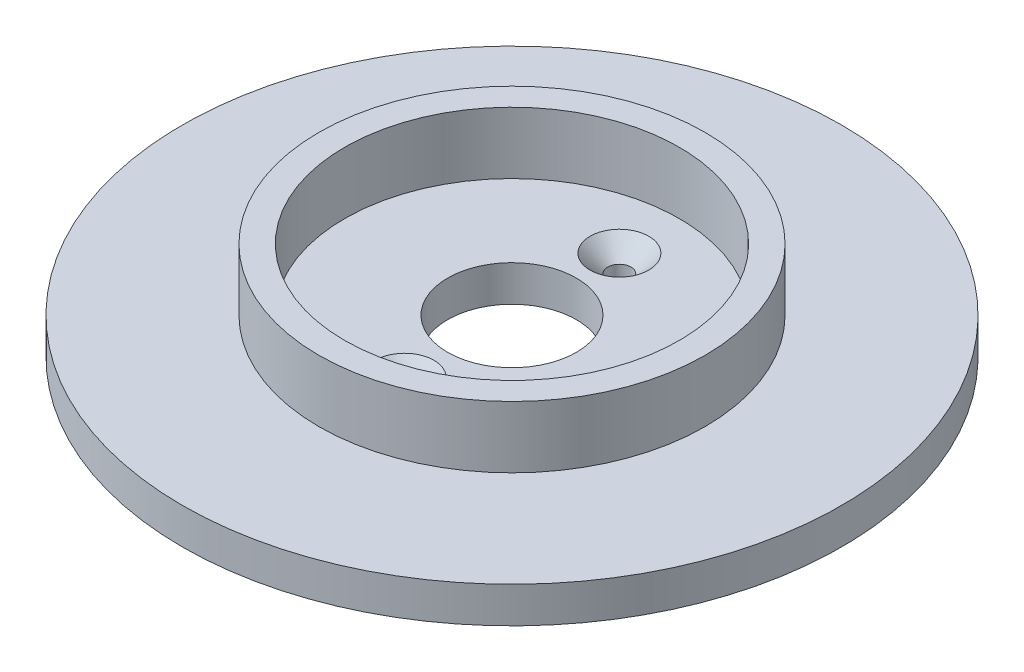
ISO-10303-21;
HEADER;
FILE_DESCRIPTION(('STEP AP214'),'2;1');
FILE_NAME('part.step','',(''),(''),'','','');
FILE_SCHEMA(('AUTOMOTIVE_DESIGN { 1 0 10303 214 1 1 1 1 }'));
ENDSEC;
DATA;
#1=APPLICATION_CONTEXT('core data for automotive mechanical design processes');
#2=APPLICATION_PROTOCOL_DEFINITION('international standard','automotive_design',2000,#1);
#3=PRODUCT_CONTEXT('',#1,'mechanical');
#4=PRODUCT('Part','Part','',(#3));
#5=PRODUCT_RELATED_PRODUCT_CATEGORY('part','',(#4));
#6=PRODUCT_DEFINITION_FORMATION('','',#4);
#7=PRODUCT_DEFINITION_CONTEXT('part definition',#1,'design');
#8=PRODUCT_DEFINITION('design','',#6,#7);
#9=PRODUCT_DEFINITION_SHAPE('','',#8);
#10=(LENGTH_UNIT() NAMED_UNIT(*) SI_UNIT(.MILLI.,.METRE.));
#11=(NAMED_UNIT(*) PLANE_ANGLE_UNIT() SI_UNIT($,.RADIAN.));
#12=(NAMED_UNIT(*) SI_UNIT($,.STERADIAN.) SOLID_ANGLE_UNIT());
#13=UNCERTAINTY_MEASURE_WITH_UNIT(LENGTH_MEASURE(1.E-05),#10,'distance_accuracy_value','');
#14=(GEOMETRIC_REPRESENTATION_CONTEXT(3) GLOBAL_UNCERTAINTY_ASSIGNED_CONTEXT((#13)) GLOBAL_UNIT_ASSIGNED_CONTEXT((#10,
#11,#12)) REPRESENTATION_CONTEXT('',''));
#15=CARTESIAN_POINT('',(0.,0.,0.));
#16=DIRECTION('',(0.,0.,1.));
#17=DIRECTION('',(1.,0.,0.));
#18=AXIS2_PLACEMENT_3D('',#15,#16,#17);
#19=CARTESIAN_POINT('',(0.,7.,0.));
#20=DIRECTION('',(0.,1.,0.));
#21=DIRECTION('',(0.,0.,1.));
#22=AXIS2_PLACEMENT_3D('',#19,#20,#21);
#23=PLANE('',#22);
#24=CARTESIAN_POINT('',(0.,7.,0.));
#25=DIRECTION('',(0.,1.,0.));
#26=DIRECTION('',(0.,0.,1.));
#27=AXIS2_PLACEMENT_3D('',#24,#25,#26);
#28=CIRCLE('',#27,64.);
#29=CARTESIAN_POINT('',(0.,7.,64.));
#30=VERTEX_POINT('',#29);
#31=EDGE_CURVE('E35',#30,#30,#28,.T.);
#32=ORIENTED_EDGE('',*,*,#31,.T.);
#33=EDGE_LOOP('',(#32));
#34=FACE_BOUND('',#33,.T.);
#35=CARTESIAN_POINT('',(0.,7.,0.));
#36=DIRECTION('',(0.,1.,0.));
#37=DIRECTION('',(0.,0.,1.));
#38=AXIS2_PLACEMENT_3D('',#35,#36,#37);
#39=CIRCLE('',#38,37.5);
#40=CARTESIAN_POINT('',(0.,7.,37.5));
#41=VERTEX_POINT('',#40);
#42=EDGE_CURVE('E46',#41,#41,#39,.T.);
#43=ORIENTED_EDGE('',*,*,#42,.F.);
#44=EDGE_LOOP('',(#43));
#45=FACE_BOUND('',#44,.T.);
#46=ADVANCED_FACE('F28',(#34,#45),#23,.T.);
#47=CARTESIAN_POINT('',(0.,7.,0.));
#48=DIRECTION('',(0.,-1.,0.));
#49=DIRECTION('',(0.,0.,-1.));
#50=AXIS2_PLACEMENT_3D('',#47,#48,#49);
#51=CYLINDRICAL_SURFACE('',#50,64.);
#52=ORIENTED_EDGE('',*,*,#31,.F.);
#53=EDGE_LOOP('',(#52));
#54=FACE_BOUND('',#53,.T.);
#55=CARTESIAN_POINT('',(0.,0.,0.));
#56=DIRECTION('',(0.,1.,0.));
#57=DIRECTION('',(0.,0.,1.));
#58=AXIS2_PLACEMENT_3D('',#55,#56,#57);
#59=CIRCLE('',#58,64.);
#60=CARTESIAN_POINT('',(0.,0.,64.));
#61=VERTEX_POINT('',#60);
#62=EDGE_CURVE('E39',#61,#61,#59,.T.);
#63=ORIENTED_EDGE('',*,*,#62,.T.);
#64=EDGE_LOOP('',(#63));
#65=FACE_BOUND('',#64,.T.);
#66=ADVANCED_FACE('F30',(#54,#65),#51,.T.);
#67=CARTESIAN_POINT('',(0.,0.,0.));
#68=DIRECTION('',(0.,1.,0.));
#69=DIRECTION('',(0.,0.,1.));
#70=AXIS2_PLACEMENT_3D('',#67,#68,#69);
#71=PLANE('',#70);
#72=CARTESIAN_POINT('',(0.,0.,-20.8566536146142));
#73=DIRECTION('',(0.,1.,0.));
#74=DIRECTION('',(0.,0.,1.));
#75=AXIS2_PLACEMENT_3D('',#72,#73,#74);
#76=CIRCLE('',#75,2.25);
#77=CARTESIAN_POINT('',(0.,0.,-18.6066536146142));
#78=VERTEX_POINT('',#77);
#79=EDGE_CURVE('E69',#78,#78,#76,.T.);
#80=ORIENTED_EDGE('',*,*,#79,.T.);
#81=EDGE_LOOP('',(#80));
#82=FACE_BOUND('',#81,.T.);
#83=CARTESIAN_POINT('',(0.,0.,20.8566536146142));
#84=DIRECTION('',(0.,1.,0.));
#85=DIRECTION('',(0.,0.,1.));
#86=AXIS2_PLACEMENT_3D('',#83,#84,#85);
#87=CIRCLE('',#86,2.25);
#88=CARTESIAN_POINT('',(0.,0.,23.1066536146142));
#89=VERTEX_POINT('',#88);
#90=EDGE_CURVE('E58',#89,#89,#87,.T.);
#91=ORIENTED_EDGE('',*,*,#90,.T.);
#92=EDGE_LOOP('',(#91));
#93=FACE_BOUND('',#92,.T.);
#94=CARTESIAN_POINT('',(0.,0.,0.));
#95=DIRECTION('',(0.,1.,0.));
#96=DIRECTION('',(0.,0.,1.));
#97=AXIS2_PLACEMENT_3D('',#94,#95,#96);
#98=CIRCLE('',#97,12.5);
#99=CARTESIAN_POINT('',(0.,0.,12.5));
#100=VERTEX_POINT('',#99);
#101=EDGE_CURVE('E54',#100,#100,#98,.T.);
#102=ORIENTED_EDGE('',*,*,#101,.T.);
#103=EDGE_LOOP('',(#102));
#104=FACE_BOUND('',#103,.T.);
#105=ORIENTED_EDGE('',*,*,#62,.F.);
#106=EDGE_LOOP('',(#105));
#107=FACE_BOUND('',#106,.T.);
#108=ADVANCED_FACE('F108',(#82,#93,#104,#107),#71,.F.);
#109=CARTESIAN_POINT('',(0.,19.,0.));
#110=DIRECTION('',(0.,1.,0.));
#111=DIRECTION('',(0.,0.,1.));
#112=AXIS2_PLACEMENT_3D('',#109,#110,#111);
#113=PLANE('',#112);
#114=CARTESIAN_POINT('',(0.,19.,0.));
#115=DIRECTION('',(0.,1.,0.));
#116=DIRECTION('',(0.,0.,1.));
#117=AXIS2_PLACEMENT_3D('',#114,#115,#116);
#118=CIRCLE('',#117,37.5);
#119=CARTESIAN_POINT('',(0.,19.,37.5));
#120=VERTEX_POINT('',#119);
#121=EDGE_CURVE('E44',#120,#120,#118,.T.);
#122=ORIENTED_EDGE('',*,*,#121,.T.);
#123=EDGE_LOOP('',(#122));
#124=FACE_BOUND('',#123,.T.);
#125=CARTESIAN_POINT('',(0.,19.,0.));
#126=DIRECTION('',(0.,1.,0.));
#127=DIRECTION('',(0.,0.,1.));
#128=AXIS2_PLACEMENT_3D('',#125,#126,#127);
#129=CIRCLE('',#128,32.5);
#130=CARTESIAN_POINT('',(0.,19.,32.5));
#131=VERTEX_POINT('',#130);
#132=EDGE_CURVE('E49',#131,#131,#129,.T.);
#133=ORIENTED_EDGE('',*,*,#132,.F.);
#134=EDGE_LOOP('',(#133));
#135=FACE_BOUND('',#134,.T.);
#136=ADVANCED_FACE('F115',(#124,#135),#113,.T.);
#137=CARTESIAN_POINT('',(0.,19.,0.));
#138=DIRECTION('',(0.,-1.,0.));
#139=DIRECTION('',(0.,0.,-1.));
#140=AXIS2_PLACEMENT_3D('',#137,#138,#139);
#141=CYLINDRICAL_SURFACE('',#140,37.5);
#142=ORIENTED_EDGE('',*,*,#121,.F.);
#143=EDGE_LOOP('',(#142));
#144=FACE_BOUND('',#143,.T.);
#145=ORIENTED_EDGE('',*,*,#42,.T.);
#146=EDGE_LOOP('',(#145));
#147=FACE_BOUND('',#146,.T.);
#148=ADVANCED_FACE('F112',(#144,#147),#141,.T.);
#149=CARTESIAN_POINT('',(0.,19.,0.));
#150=DIRECTION('',(0.,-1.,0.));
#151=DIRECTION('',(0.,0.,-1.));
#152=AXIS2_PLACEMENT_3D('',#149,#150,#151);
#153=CYLINDRICAL_SURFACE('',#152,32.5);
#154=ORIENTED_EDGE('',*,*,#132,.T.);
#155=EDGE_LOOP('',(#154));
#156=FACE_BOUND('',#155,.T.);
#157=CARTESIAN_POINT('',(0.,7.,0.));
#158=DIRECTION('',(0.,1.,0.));
#159=DIRECTION('',(0.,0.,1.));
#160=AXIS2_PLACEMENT_3D('',#157,#158,#159);
#161=CIRCLE('',#160,32.5);
#162=CARTESIAN_POINT('',(0.,7.,32.5));
#163=VERTEX_POINT('',#162);
#164=EDGE_CURVE('E10',#163,#163,#161,.F.);
#165=ORIENTED_EDGE('',*,*,#164,.T.);
#166=EDGE_LOOP('',(#165));
#167=FACE_BOUND('',#166,.T.);
#168=ADVANCED_FACE('F85',(#156,#167),#153,.F.);
#169=CARTESIAN_POINT('',(0.,7.,-20.8566536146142));
#170=DIRECTION('',(0.,1.,0.));
#171=DIRECTION('',(0.,0.,1.));
#172=AXIS2_PLACEMENT_3D('',#169,#170,#171);
#173=CIRCLE('',#172,5.7);
#174=CARTESIAN_POINT('',(0.,7.,-15.1566536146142));
#175=VERTEX_POINT('',#174);
#176=EDGE_CURVE('E75',#175,#175,#173,.T.);
#177=ORIENTED_EDGE('',*,*,#176,.F.);
#178=EDGE_LOOP('',(#177));
#179=FACE_BOUND('',#178,.T.);
#180=CARTESIAN_POINT('',(0.,7.,20.8566536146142));
#181=DIRECTION('',(0.,1.,0.));
#182=DIRECTION('',(0.,0.,1.));
#183=AXIS2_PLACEMENT_3D('',#180,#181,#182);
#184=CIRCLE('',#183,5.7);
#185=CARTESIAN_POINT('',(0.,7.,26.5566536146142));
#186=VERTEX_POINT('',#185);
#187=EDGE_CURVE('E66',#186,#186,#184,.T.);
#188=ORIENTED_EDGE('',*,*,#187,.F.);
#189=EDGE_LOOP('',(#188));
#190=FACE_BOUND('',#189,.T.);
#191=CARTESIAN_POINT('',(0.,7.,0.));
#192=DIRECTION('',(0.,1.,0.));
#193=DIRECTION('',(0.,0.,1.));
#194=AXIS2_PLACEMENT_3D('',#191,#192,#193);
#195=CIRCLE('',#194,12.5);
#196=CARTESIAN_POINT('',(0.,7.,12.5));
#197=VERTEX_POINT('',#196);
#198=EDGE_CURVE('E55',#197,#197,#195,.T.);
#199=ORIENTED_EDGE('',*,*,#198,.F.);
#200=EDGE_LOOP('',(#199));
#201=FACE_BOUND('',#200,.T.);
#202=ORIENTED_EDGE('',*,*,#164,.F.);
#203=EDGE_LOOP('',(#202));
#204=FACE_BOUND('',#203,.T.);
#205=ADVANCED_FACE('F81',(#179,#190,#201,#204),#23,.T.);
#206=CARTESIAN_POINT('',(0.,0.,0.));
#207=DIRECTION('',(0.,1.,0.));
#208=DIRECTION('',(0.,0.,1.));
#209=AXIS2_PLACEMENT_3D('',#206,#207,#208);
#210=CYLINDRICAL_SURFACE('',#209,12.5);
#211=ORIENTED_EDGE('',*,*,#101,.F.);
#212=EDGE_LOOP('',(#211));
#213=FACE_BOUND('',#212,.T.);
#214=ORIENTED_EDGE('',*,*,#198,.T.);
#215=EDGE_LOOP('',(#214));
#216=FACE_BOUND('',#215,.T.);
#217=ADVANCED_FACE('F84',(#213,#216),#210,.F.);
#218=CARTESIAN_POINT('',(0.,7.,20.8566536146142));
#219=DIRECTION('',(0.,1.,0.));
#220=DIRECTION('',(0.,0.,1.));
#221=AXIS2_PLACEMENT_3D('',#218,#219,#220);
#222=CYLINDRICAL_SURFACE('',#221,2.25);
#223=ORIENTED_EDGE('',*,*,#90,.F.);
#224=EDGE_LOOP('',(#223));
#225=FACE_BOUND('',#224,.T.);
#226=CARTESIAN_POINT('',(0.,3.55,20.8566536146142));
#227=DIRECTION('',(0.,1.,0.));
#228=DIRECTION('',(0.,0.,1.));
#229=AXIS2_PLACEMENT_3D('',#226,#227,#228);
#230=CIRCLE('',#229,2.25);
#231=CARTESIAN_POINT('',(0.,3.55,23.1066536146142));
#232=VERTEX_POINT('',#231);
#233=EDGE_CURVE('E63',#232,#232,#230,.T.);
#234=ORIENTED_EDGE('',*,*,#233,.T.);
#235=EDGE_LOOP('',(#234));
#236=FACE_BOUND('',#235,.T.);
#237=ADVANCED_FACE('F93',(#225,#236),#222,.F.);
#238=CARTESIAN_POINT('',(0.,7.,20.8566536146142));
#239=DIRECTION('',(0.,1.,0.));
#240=DIRECTION('',(0.,0.,1.));
#241=AXIS2_PLACEMENT_3D('',#238,#239,#240);
#242=CONICAL_SURFACE('',#241,5.7,0.785398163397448);
#243=ORIENTED_EDGE('',*,*,#233,.F.);
#244=EDGE_LOOP('',(#243));
#245=FACE_BOUND('',#244,.T.);
#246=ORIENTED_EDGE('',*,*,#187,.T.);
#247=EDGE_LOOP('',(#246));
#248=FACE_BOUND('',#247,.T.);
#249=ADVANCED_FACE('F99',(#245,#248),#242,.F.);
#250=CARTESIAN_POINT('',(0.,7.,-20.8566536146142));
#251=DIRECTION('',(0.,1.,0.));
#252=DIRECTION('',(0.,0.,1.));
#253=AXIS2_PLACEMENT_3D('',#250,#251,#252);
#254=CYLINDRICAL_SURFACE('',#253,2.25);
#255=ORIENTED_EDGE('',*,*,#79,.F.);
#256=EDGE_LOOP('',(#255));
#257=FACE_BOUND('',#256,.T.);
#258=CARTESIAN_POINT('',(0.,3.55,-20.8566536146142));
#259=DIRECTION('',(0.,1.,0.));
#260=DIRECTION('',(0.,0.,1.));
#261=AXIS2_PLACEMENT_3D('',#258,#259,#260);
#262=CIRCLE('',#261,2.25);
#263=CARTESIAN_POINT('',(0.,3.55,-18.6066536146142));
#264=VERTEX_POINT('',#263);
#265=EDGE_CURVE('E72',#264,#264,#262,.T.);
#266=ORIENTED_EDGE('',*,*,#265,.T.);
#267=EDGE_LOOP('',(#266));
#268=FACE_BOUND('',#267,.T.);
#269=ADVANCED_FACE('F133',(#257,#268),#254,.F.);
#270=CARTESIAN_POINT('',(0.,7.,-20.8566536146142));
#271=DIRECTION('',(0.,1.,0.));
#272=DIRECTION('',(0.,0.,1.));
#273=AXIS2_PLACEMENT_3D('',#270,#271,#272);
#274=CONICAL_SURFACE('',#273,5.7,0.785398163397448);
#275=ORIENTED_EDGE('',*,*,#265,.F.);
#276=EDGE_LOOP('',(#275));
#277=FACE_BOUND('',#276,.T.);
#278=ORIENTED_EDGE('',*,*,#176,.T.);
#279=EDGE_LOOP('',(#278));
#280=FACE_BOUND('',#279,.T.);
#281=ADVANCED_FACE('F79',(#277,#280),#274,.F.);
#282=CLOSED_SHELL('',(#46,#66,#108,#136,#148,#168,#205,#217,#237,#249,#269,#281));
#283=MANIFOLD_SOLID_BREP('B2',#282);
#284=ADVANCED_BREP_SHAPE_REPRESENTATION('',(#18,#283),#14);
#285=SHAPE_DEFINITION_REPRESENTATION(#9,#284);
ENDSEC;
END-ISO-10303-21;
